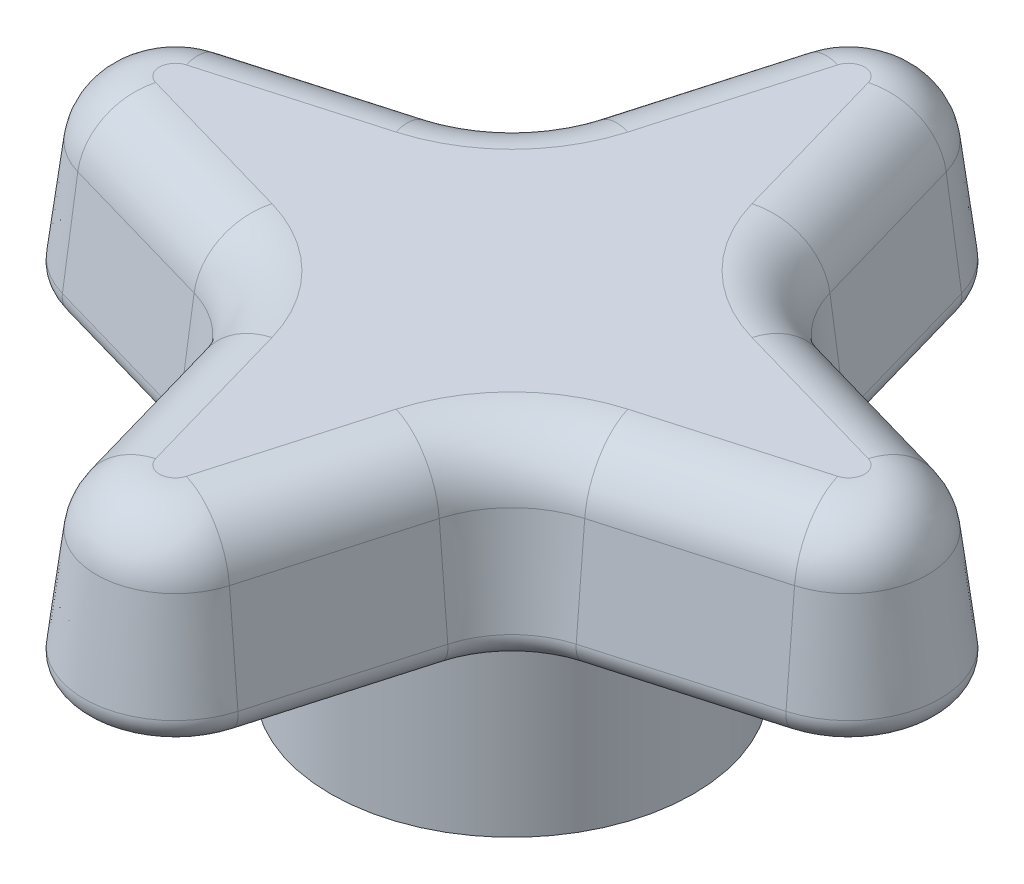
from build123d import *

# Parameters (mm, degrees)
EXTRUDE1_DEPTH = 6.35
EXTRUDE1_TAPER = 7.000000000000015
FILLET1_R      = 2.2224999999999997
SKETCH2_R      = 6.35
SKETCH2_R_2    = 4.921250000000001
EXTRUDE2_DEPTH = 6.35
FILLET2_R      = 0.762


with BuildPart() as part:
    # Sketch1 → Extrude1 (new body)
    with BuildSketch(Plane(origin=(0, 0, 0), x_dir=(1, 0, 0), z_dir=(0, 1, 0))):
        with BuildLine():
            ThreePointArc((3.175, 12.7), (2e-16, 15.09253410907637), (-3.175, 12.7))
            Line((-3.175, 12.7), (-4.812500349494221, 6.989357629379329))
            ThreePointArc((-4.812500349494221, 6.989357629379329), (-5.619442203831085, 5.619442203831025), (-6.98935762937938, 4.8125003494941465))
            Line((-6.98935762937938, 4.8125003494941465), (-12.700000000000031, 3.174999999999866))
            ThreePointArc((-12.700000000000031, 3.174999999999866), (-15.092534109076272, 4e-16), (-12.700000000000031, -3.174999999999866))
            Line((-12.700000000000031, -3.174999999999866), (-6.98935762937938, -4.8125003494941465))
            ThreePointArc((-6.98935762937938, -4.8125003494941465), (-5.619442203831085, -5.619442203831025), (-4.812500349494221, -6.989357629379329))
            Line((-4.812500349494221, -6.989357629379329), (-3.175, -12.7))
            ThreePointArc((-3.175, -12.7), (2e-16, -15.09253410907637), (3.175, -12.7))
            Line((3.175, -12.7), (4.812500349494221, -6.989357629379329))
            ThreePointArc((4.812500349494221, -6.989357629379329), (5.619442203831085, -5.619442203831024), (6.98935762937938, -4.8125003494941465))
            Line((6.98935762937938, -4.8125003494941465), (12.700000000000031, -3.174999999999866))
            ThreePointArc((12.700000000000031, -3.174999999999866), (15.092534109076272, 0), (12.700000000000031, 3.174999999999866))
            Line((12.700000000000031, 3.174999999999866), (6.98935762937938, 4.8125003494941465))
            ThreePointArc((6.98935762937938, 4.8125003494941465), (5.619442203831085, 5.6194422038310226), (4.812500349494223, 6.989357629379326))
            Line((4.812500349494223, 6.989357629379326), (3.175, 12.7))
        make_face()
    extrude(amount=EXTRUDE1_DEPTH, taper=EXTRUDE1_TAPER)

    # Fillet1
    fillet1_edges = [part.edges().sort_by_distance(p)[0] for p in [
        (3.244271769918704, 6.35, -9.629769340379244),
        (2e-15, 6.35, -14.312852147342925),
        (-3.2442717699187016, 6.35, -9.62976934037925),
        (-5.0681238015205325, 6.35, -5.068123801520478),
        (-9.629769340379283, 6.35, -3.2442717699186),
        (-14.312852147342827, 6.35, 5.6e-16),
        (-9.629769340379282, 6.35, 3.2442717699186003),
        (-5.068123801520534, 6.35, 5.068123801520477),
        (-3.244271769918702, 6.35, 9.62976934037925),
        (-2e-15, 6.35, 14.312852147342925),
        (3.244271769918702, 6.35, 9.629769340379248),
        (5.068123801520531, 6.35, 5.06812380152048),
        (9.62976934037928, 6.35, 3.244271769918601),
        (14.312852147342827, 6.35, -1.89e-15),
        (9.629769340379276, 6.35, -3.2442717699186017),
        (5.068123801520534, 6.35, -5.068123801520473),
    ]]
    fillet(fillet1_edges, radius=FILLET1_R)

    # Sketch2 → Extrude2 (add)
    with BuildSketch(Plane.XZ):
        with Locations(Location((0, 0, 0), (0, 0, 270))):
            Circle(SKETCH2_R)
        with Locations(Location((0, 0, 0), (0, 0, 270))):
            Circle(SKETCH2_R_2, mode=Mode.SUBTRACT)
    extrude(amount=EXTRUDE2_DEPTH)

    # Fillet2
    fillet2_edges = [part.edges().sort_by_distance(p)[0] for p in [
        (3.9937501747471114, 0, -9.844678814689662),
        (1.1e-16, 0, -15.09253410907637),
        (5.619442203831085, 0, -5.6194422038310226),
        (9.844678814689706, 0, -3.9937501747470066),
        (-3.9937501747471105, 0, -9.844678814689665),
        (15.092534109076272, 0, 4.4e-16),
        (-5.619442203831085, 0, -5.619442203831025),
        (9.844678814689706, 0, 3.9937501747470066),
        (-9.844678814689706, 0, -3.9937501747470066),
        (5.619442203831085, 0, 5.619442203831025),
        (-15.092534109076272, 0, 2.2e-16),
        (3.9937501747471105, 0, 9.844678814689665),
        (-9.844678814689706, 0, 3.9937501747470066),
        (-1.1e-16, 0, 15.09253410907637),
        (-5.619442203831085, 0, 5.619442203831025),
        (-3.9937501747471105, 0, 9.844678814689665),
    ]]
    fillet(fillet2_edges, radius=FILLET2_R)


solid = part.part
